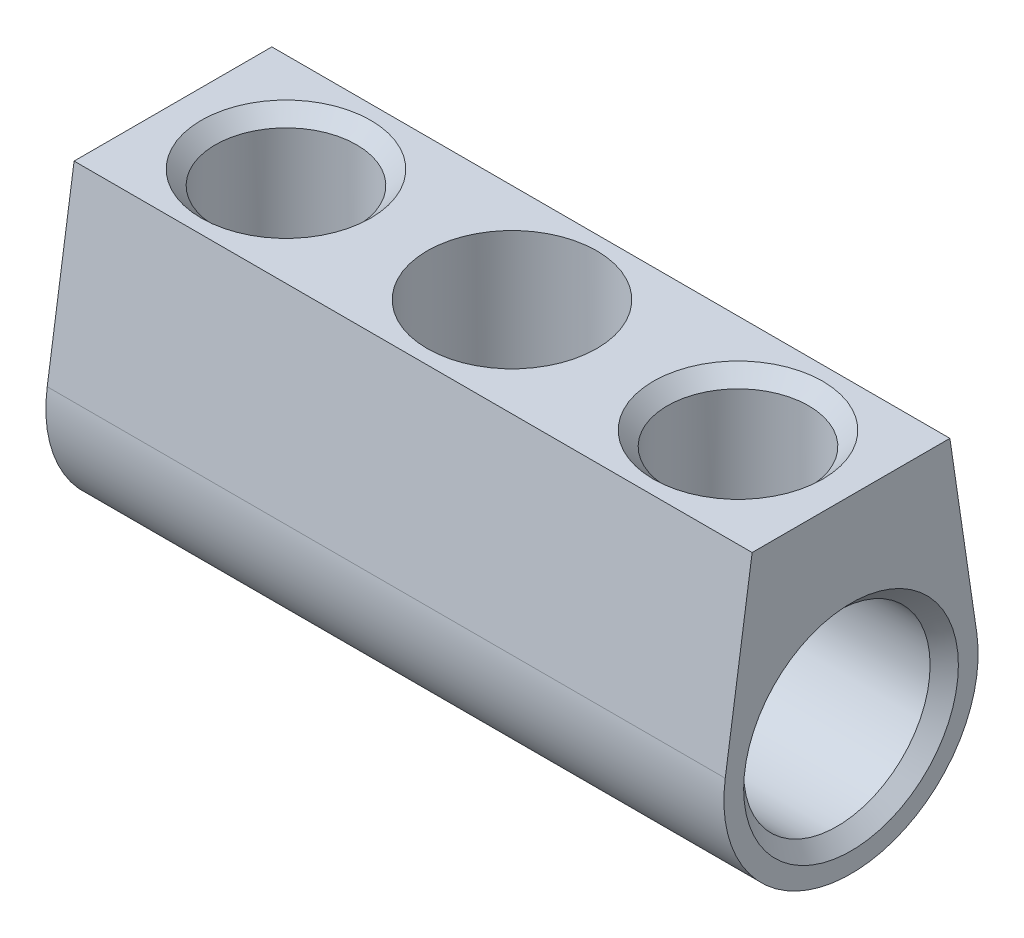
from build123d import *

# Parameters (mm, degrees)
SKETCH1_R               = 1.65
EXTRUDE1_DEPTH          = 6
SKETCH2_R               = 1.25
CUT_EXTRUDE1_DEPTH      = 8.325639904
CUT_EXTRUDE2_DEPTH      = 8.325640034
CUT_EXTRUDE2_DEPTH_BACK = 8.325640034
SKETCH3_R               = 1.5
CHAMFER1_SIZE           = 0.25


with BuildPart() as part:
    # Sketch1 → Extrude1 (new, symmetric)
    with BuildSketch(Plane(origin=(0, 0, 0), x_dir=(0, 0, -1), z_dir=(1, 0, 0))):
        with BuildLine():
            Line((-2.225844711, 0.328808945), (-1.75, 3.55))
            Line((-1.75, 3.55), (1.75, 3.55))
            Line((1.75, 3.55), (2.225844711, 0.328808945))
            ThreePointArc((2.225844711, 0.328808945), (0, -2.25), (-2.225844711, 0.328808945))
        make_face()
        Circle(SKETCH1_R, mode=Mode.SUBTRACT)
    extrude(amount=EXTRUDE1_DEPTH, both=True)

    # Sketch2 → Cut-Extrude1 (cut, through all)
    with BuildSketch(Plane(origin=(0, 0, 0), x_dir=(1, 0, 0), z_dir=(0, 1, 0))):
        with Locations(Location((-4, 0, 0), (0, 0, 90))):
            Circle(SKETCH2_R)
        with Locations(Location((4, 0, 0), (0, 0, 90))):
            Circle(SKETCH2_R)
    extrude(amount=CUT_EXTRUDE1_DEPTH, mode=Mode.SUBTRACT)

    # Sketch3 → Cut-Extrude2 (cut, two sides: drawn at the far end of the back side and taken through both)
    with BuildSketch(Plane(origin=(0, 0, 0), x_dir=(1, 0, 0), z_dir=(0, 1, 0)).offset(-CUT_EXTRUDE2_DEPTH_BACK)):
        with Locations(Location((0, 0, 0), (0, 0, 270))):
            Circle(SKETCH3_R)
    extrude(amount=CUT_EXTRUDE2_DEPTH + CUT_EXTRUDE2_DEPTH_BACK, mode=Mode.SUBTRACT)

    # Chamfer1
    chamfer1_edges = [part.edges().sort_by_distance(p)[0] for p in [
        (-6, 0, 1.65),
        (6, 0, 1.65),
        (-4, 3.55, 1.25),
        (4, 3.55, 1.25),
    ]]
    chamfer(chamfer1_edges, length=CHAMFER1_SIZE)


solid = part.part
